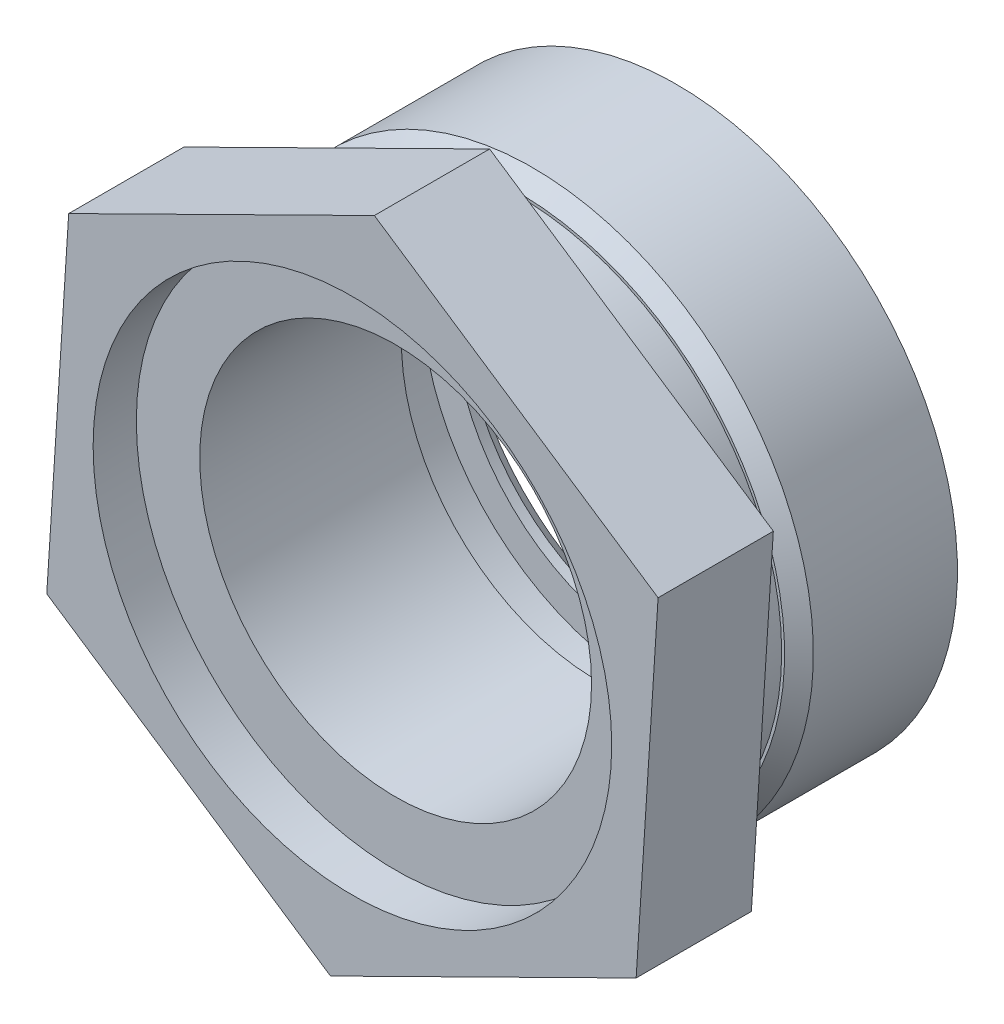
ISO-10303-21;
HEADER;
FILE_DESCRIPTION(('STEP AP214'),'2;1');
FILE_NAME('part.step','',(''),(''),'','','');
FILE_SCHEMA(('AUTOMOTIVE_DESIGN { 1 0 10303 214 1 1 1 1 }'));
ENDSEC;
DATA;
#1=APPLICATION_CONTEXT('core data for automotive mechanical design processes');
#2=APPLICATION_PROTOCOL_DEFINITION('international standard','automotive_design',2000,#1);
#3=PRODUCT_CONTEXT('',#1,'mechanical');
#4=PRODUCT('Part','Part','',(#3));
#5=PRODUCT_RELATED_PRODUCT_CATEGORY('part','',(#4));
#6=PRODUCT_DEFINITION_FORMATION('','',#4);
#7=PRODUCT_DEFINITION_CONTEXT('part definition',#1,'design');
#8=PRODUCT_DEFINITION('design','',#6,#7);
#9=PRODUCT_DEFINITION_SHAPE('','',#8);
#10=(LENGTH_UNIT() NAMED_UNIT(*) SI_UNIT(.MILLI.,.METRE.));
#11=(NAMED_UNIT(*) PLANE_ANGLE_UNIT() SI_UNIT($,.RADIAN.));
#12=(NAMED_UNIT(*) SI_UNIT($,.STERADIAN.) SOLID_ANGLE_UNIT());
#13=UNCERTAINTY_MEASURE_WITH_UNIT(LENGTH_MEASURE(1.E-05),#10,'distance_accuracy_value','');
#14=(GEOMETRIC_REPRESENTATION_CONTEXT(3) GLOBAL_UNCERTAINTY_ASSIGNED_CONTEXT((#13)) GLOBAL_UNIT_ASSIGNED_CONTEXT((#10,
#11,#12)) REPRESENTATION_CONTEXT('',''));
#15=CARTESIAN_POINT('',(0.,0.,0.));
#16=DIRECTION('',(0.,0.,1.));
#17=DIRECTION('',(1.,0.,0.));
#18=AXIS2_PLACEMENT_3D('',#15,#16,#17);
#19=CARTESIAN_POINT('',(0.,0.,-14.5));
#20=DIRECTION('',(0.,0.,1.));
#21=DIRECTION('',(1.,0.,0.));
#22=AXIS2_PLACEMENT_3D('',#19,#20,#21);
#23=CYLINDRICAL_SURFACE('',#22,13.6);
#24=CARTESIAN_POINT('',(0.,0.,-12.6));
#25=DIRECTION('',(0.,0.,-1.));
#26=DIRECTION('',(-1.,0.,0.));
#27=AXIS2_PLACEMENT_3D('',#24,#25,#26);
#28=CIRCLE('',#27,13.6);
#29=CARTESIAN_POINT('',(-13.6,0.,-12.6));
#30=VERTEX_POINT('',#29);
#31=EDGE_CURVE('E162',#30,#30,#28,.F.);
#32=ORIENTED_EDGE('',*,*,#31,.T.);
#33=EDGE_LOOP('',(#32));
#34=FACE_BOUND('',#33,.T.);
#35=CARTESIAN_POINT('',(0.,0.,-13.3));
#36=DIRECTION('',(0.,0.,-1.));
#37=DIRECTION('',(-1.,0.,0.));
#38=AXIS2_PLACEMENT_3D('',#35,#36,#37);
#39=CIRCLE('',#38,13.6);
#40=CARTESIAN_POINT('',(-13.6,0.,-13.3));
#41=VERTEX_POINT('',#40);
#42=EDGE_CURVE('E155',#41,#41,#39,.T.);
#43=ORIENTED_EDGE('',*,*,#42,.T.);
#44=EDGE_LOOP('',(#43));
#45=FACE_BOUND('',#44,.T.);
#46=ADVANCED_FACE('F37',(#34,#45),#23,.F.);
#47=CARTESIAN_POINT('',(-1.52347256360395,-23.6222853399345,8.));
#48=DIRECTION('',(-0.443226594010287,0.896409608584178,0.));
#49=DIRECTION('',(-0.896409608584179,-0.443226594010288,0.));
#50=AXIS2_PLACEMENT_3D('',#47,#48,#49);
#51=PLANE('',#50);
#52=DIRECTION('',(0.896409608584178,0.443226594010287,0.));
#53=VECTOR('',#52,1.);
#54=CARTESIAN_POINT('',(-1.52347256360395,-23.6222853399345,0.));
#55=LINE('',#54,#53);
#56=CARTESIAN_POINT('',(-1.52347256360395,-23.6222853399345,0.));
#57=VERTEX_POINT('',#56);
#58=CARTESIAN_POINT('',(19.695762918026,-13.130508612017,0.));
#59=VERTEX_POINT('',#58);
#60=EDGE_CURVE('E95',#57,#59,#55,.T.);
#61=ORIENTED_EDGE('',*,*,#60,.T.);
#62=DIRECTION('',(0.,0.,-1.));
#63=VECTOR('',#62,1.);
#64=CARTESIAN_POINT('',(19.695762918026,-13.130508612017,8.));
#65=LINE('',#64,#63);
#66=CARTESIAN_POINT('',(19.695762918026,-13.130508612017,8.));
#67=VERTEX_POINT('',#66);
#68=EDGE_CURVE('E103',#67,#59,#65,.T.);
#69=ORIENTED_EDGE('',*,*,#68,.F.);
#70=DIRECTION('',(0.896409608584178,0.443226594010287,0.));
#71=VECTOR('',#70,1.);
#72=CARTESIAN_POINT('',(-1.52347256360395,-23.6222853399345,8.));
#73=LINE('',#72,#71);
#74=CARTESIAN_POINT('',(-1.52347256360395,-23.6222853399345,8.));
#75=VERTEX_POINT('',#74);
#76=EDGE_CURVE('E127',#75,#67,#73,.T.);
#77=ORIENTED_EDGE('',*,*,#76,.F.);
#78=DIRECTION('',(0.,0.,-1.));
#79=VECTOR('',#78,1.);
#80=CARTESIAN_POINT('',(-1.52347256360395,-23.6222853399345,8.));
#81=LINE('',#80,#79);
#82=EDGE_CURVE('E112',#75,#57,#81,.T.);
#83=ORIENTED_EDGE('',*,*,#82,.T.);
#84=EDGE_LOOP('',(#61,#69,#77,#83));
#85=FACE_BOUND('',#84,.T.);
#86=ADVANCED_FACE('F39',(#85),#51,.F.);
#87=CARTESIAN_POINT('',(19.695762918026,-13.130508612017,8.));
#88=DIRECTION('',(-0.997926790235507,0.0643593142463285,0.));
#89=DIRECTION('',(-0.0643593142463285,-0.997926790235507,0.));
#90=AXIS2_PLACEMENT_3D('',#87,#88,#89);
#91=PLANE('',#90);
#92=DIRECTION('',(0.0643593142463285,0.997926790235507,0.));
#93=VECTOR('',#92,1.);
#94=CARTESIAN_POINT('',(19.695762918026,-13.130508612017,0.));
#95=LINE('',#94,#93);
#96=CARTESIAN_POINT('',(21.2192354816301,10.4917767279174,0.));
#97=VERTEX_POINT('',#96);
#98=EDGE_CURVE('E90',#59,#97,#95,.T.);
#99=ORIENTED_EDGE('',*,*,#98,.T.);
#100=DIRECTION('',(0.,0.,-1.));
#101=VECTOR('',#100,1.);
#102=CARTESIAN_POINT('',(21.2192354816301,10.4917767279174,8.));
#103=LINE('',#102,#101);
#104=CARTESIAN_POINT('',(21.2192354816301,10.4917767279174,8.));
#105=VERTEX_POINT('',#104);
#106=EDGE_CURVE('E109',#105,#97,#103,.T.);
#107=ORIENTED_EDGE('',*,*,#106,.F.);
#108=DIRECTION('',(0.0643593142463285,0.997926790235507,0.));
#109=VECTOR('',#108,1.);
#110=CARTESIAN_POINT('',(19.695762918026,-13.130508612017,8.));
#111=LINE('',#110,#109);
#112=EDGE_CURVE('E105',#67,#105,#111,.T.);
#113=ORIENTED_EDGE('',*,*,#112,.F.);
#114=ORIENTED_EDGE('',*,*,#68,.T.);
#115=EDGE_LOOP('',(#99,#107,#113,#114));
#116=FACE_BOUND('',#115,.T.);
#117=ADVANCED_FACE('F104',(#116),#91,.F.);
#118=CARTESIAN_POINT('',(21.2192354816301,10.4917767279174,8.));
#119=DIRECTION('',(-0.55470019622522,-0.83205029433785,0.));
#120=DIRECTION('',(0.83205029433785,-0.55470019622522,0.));
#121=AXIS2_PLACEMENT_3D('',#118,#119,#120);
#122=PLANE('',#121);
#123=DIRECTION('',(-0.83205029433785,0.55470019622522,0.));
#124=VECTOR('',#123,1.);
#125=CARTESIAN_POINT('',(21.2192354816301,10.4917767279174,0.));
#126=LINE('',#125,#124);
#127=CARTESIAN_POINT('',(1.5234725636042,23.6222853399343,0.));
#128=VERTEX_POINT('',#127);
#129=EDGE_CURVE('E97',#97,#128,#126,.T.);
#130=ORIENTED_EDGE('',*,*,#129,.T.);
#131=DIRECTION('',(0.,0.,-1.));
#132=VECTOR('',#131,1.);
#133=CARTESIAN_POINT('',(1.5234725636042,23.6222853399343,8.));
#134=LINE('',#133,#132);
#135=CARTESIAN_POINT('',(1.5234725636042,23.6222853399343,8.));
#136=VERTEX_POINT('',#135);
#137=EDGE_CURVE('E143',#136,#128,#134,.T.);
#138=ORIENTED_EDGE('',*,*,#137,.F.);
#139=DIRECTION('',(-0.83205029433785,0.55470019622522,0.));
#140=VECTOR('',#139,1.);
#141=CARTESIAN_POINT('',(21.2192354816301,10.4917767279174,8.));
#142=LINE('',#141,#140);
#143=EDGE_CURVE('E130',#105,#136,#142,.T.);
#144=ORIENTED_EDGE('',*,*,#143,.F.);
#145=ORIENTED_EDGE('',*,*,#106,.T.);
#146=EDGE_LOOP('',(#130,#138,#144,#145));
#147=FACE_BOUND('',#146,.T.);
#148=ADVANCED_FACE('F271',(#147),#122,.F.);
#149=CARTESIAN_POINT('',(1.5234725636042,23.6222853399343,8.));
#150=DIRECTION('',(0.443226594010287,-0.896409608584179,0.));
#151=DIRECTION('',(0.896409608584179,0.443226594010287,0.));
#152=AXIS2_PLACEMENT_3D('',#149,#150,#151);
#153=PLANE('',#152);
#154=DIRECTION('',(-0.896409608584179,-0.443226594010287,0.));
#155=VECTOR('',#154,1.);
#156=CARTESIAN_POINT('',(1.5234725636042,23.6222853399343,0.));
#157=LINE('',#156,#155);
#158=CARTESIAN_POINT('',(-19.6957629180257,13.1305086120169,0.));
#159=VERTEX_POINT('',#158);
#160=EDGE_CURVE('E121',#128,#159,#157,.T.);
#161=ORIENTED_EDGE('',*,*,#160,.T.);
#162=DIRECTION('',(0.,0.,-1.));
#163=VECTOR('',#162,1.);
#164=CARTESIAN_POINT('',(-19.6957629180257,13.1305086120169,8.));
#165=LINE('',#164,#163);
#166=CARTESIAN_POINT('',(-19.6957629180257,13.1305086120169,8.));
#167=VERTEX_POINT('',#166);
#168=EDGE_CURVE('E140',#167,#159,#165,.T.);
#169=ORIENTED_EDGE('',*,*,#168,.F.);
#170=DIRECTION('',(-0.896409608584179,-0.443226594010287,0.));
#171=VECTOR('',#170,1.);
#172=CARTESIAN_POINT('',(1.5234725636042,23.6222853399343,8.));
#173=LINE('',#172,#171);
#174=EDGE_CURVE('E132',#136,#167,#173,.T.);
#175=ORIENTED_EDGE('',*,*,#174,.F.);
#176=ORIENTED_EDGE('',*,*,#137,.T.);
#177=EDGE_LOOP('',(#161,#169,#175,#176));
#178=FACE_BOUND('',#177,.T.);
#179=ADVANCED_FACE('F267',(#178),#153,.F.);
#180=CARTESIAN_POINT('',(-19.6957629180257,13.1305086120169,8.));
#181=DIRECTION('',(0.997926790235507,-0.0643593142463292,0.));
#182=DIRECTION('',(0.0643593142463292,0.997926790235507,0.));
#183=AXIS2_PLACEMENT_3D('',#180,#181,#182);
#184=PLANE('',#183);
#185=DIRECTION('',(-0.0643593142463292,-0.997926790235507,0.));
#186=VECTOR('',#185,1.);
#187=CARTESIAN_POINT('',(-19.6957629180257,13.1305086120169,0.));
#188=LINE('',#187,#186);
#189=CARTESIAN_POINT('',(-21.2192354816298,-10.4917767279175,0.));
#190=VERTEX_POINT('',#189);
#191=EDGE_CURVE('E123',#159,#190,#188,.T.);
#192=ORIENTED_EDGE('',*,*,#191,.T.);
#193=DIRECTION('',(0.,0.,-1.));
#194=VECTOR('',#193,1.);
#195=CARTESIAN_POINT('',(-21.2192354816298,-10.4917767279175,8.));
#196=LINE('',#195,#194);
#197=CARTESIAN_POINT('',(-21.2192354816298,-10.4917767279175,8.));
#198=VERTEX_POINT('',#197);
#199=EDGE_CURVE('E137',#198,#190,#196,.T.);
#200=ORIENTED_EDGE('',*,*,#199,.F.);
#201=DIRECTION('',(-0.0643593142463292,-0.997926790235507,0.));
#202=VECTOR('',#201,1.);
#203=CARTESIAN_POINT('',(-19.6957629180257,13.1305086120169,8.));
#204=LINE('',#203,#202);
#205=EDGE_CURVE('E57',#167,#198,#204,.T.);
#206=ORIENTED_EDGE('',*,*,#205,.F.);
#207=ORIENTED_EDGE('',*,*,#168,.T.);
#208=EDGE_LOOP('',(#192,#200,#206,#207));
#209=FACE_BOUND('',#208,.T.);
#210=ADVANCED_FACE('F263',(#209),#184,.F.);
#211=CARTESIAN_POINT('',(-21.2192354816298,-10.4917767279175,8.));
#212=DIRECTION('',(0.55470019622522,0.83205029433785,0.));
#213=DIRECTION('',(-0.83205029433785,0.55470019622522,0.));
#214=AXIS2_PLACEMENT_3D('',#211,#212,#213);
#215=PLANE('',#214);
#216=DIRECTION('',(0.83205029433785,-0.55470019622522,0.));
#217=VECTOR('',#216,1.);
#218=CARTESIAN_POINT('',(-21.2192354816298,-10.4917767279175,0.));
#219=LINE('',#218,#217);
#220=EDGE_CURVE('E125',#190,#57,#219,.T.);
#221=ORIENTED_EDGE('',*,*,#220,.T.);
#222=ORIENTED_EDGE('',*,*,#82,.F.);
#223=DIRECTION('',(0.83205029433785,-0.55470019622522,0.));
#224=VECTOR('',#223,1.);
#225=CARTESIAN_POINT('',(-21.2192354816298,-10.4917767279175,8.));
#226=LINE('',#225,#224);
#227=EDGE_CURVE('E52',#198,#75,#226,.T.);
#228=ORIENTED_EDGE('',*,*,#227,.F.);
#229=ORIENTED_EDGE('',*,*,#199,.T.);
#230=EDGE_LOOP('',(#221,#222,#228,#229));
#231=FACE_BOUND('',#230,.T.);
#232=ADVANCED_FACE('F259',(#231),#215,.F.);
#233=CARTESIAN_POINT('',(40.9149983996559,-2.63873188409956,8.));
#234=DIRECTION('',(0.,0.,1.));
#235=DIRECTION('',(1.,0.,0.));
#236=AXIS2_PLACEMENT_3D('',#233,#234,#235);
#237=PLANE('',#236);
#238=CARTESIAN_POINT('',(0.,0.,8.));
#239=DIRECTION('',(0.,0.,1.));
#240=DIRECTION('',(1.,0.,0.));
#241=AXIS2_PLACEMENT_3D('',#238,#239,#240);
#242=CIRCLE('',#241,18.);
#243=CARTESIAN_POINT('',(18.,0.,8.));
#244=VERTEX_POINT('',#243);
#245=EDGE_CURVE('E232',#244,#244,#242,.T.);
#246=ORIENTED_EDGE('',*,*,#245,.F.);
#247=EDGE_LOOP('',(#246));
#248=FACE_BOUND('',#247,.T.);
#249=ORIENTED_EDGE('',*,*,#76,.T.);
#250=ORIENTED_EDGE('',*,*,#112,.T.);
#251=ORIENTED_EDGE('',*,*,#143,.T.);
#252=ORIENTED_EDGE('',*,*,#174,.T.);
#253=ORIENTED_EDGE('',*,*,#205,.T.);
#254=ORIENTED_EDGE('',*,*,#227,.T.);
#255=EDGE_LOOP('',(#249,#250,#251,#252,#253,#254));
#256=FACE_BOUND('',#255,.T.);
#257=ADVANCED_FACE('F255',(#248,#256),#237,.T.);
#258=CARTESIAN_POINT('',(40.9149983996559,-2.63873188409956,0.));
#259=DIRECTION('',(0.,0.,1.));
#260=DIRECTION('',(1.,0.,0.));
#261=AXIS2_PLACEMENT_3D('',#258,#259,#260);
#262=PLANE('',#261);
#263=CARTESIAN_POINT('',(0.,0.,0.));
#264=DIRECTION('',(0.,0.,1.));
#265=DIRECTION('',(1.,0.,0.));
#266=AXIS2_PLACEMENT_3D('',#263,#264,#265);
#267=CIRCLE('',#266,19.5828427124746);
#268=CARTESIAN_POINT('',(19.5828427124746,0.,0.));
#269=VERTEX_POINT('',#268);
#270=EDGE_CURVE('E11',#269,#269,#267,.T.);
#271=ORIENTED_EDGE('',*,*,#270,.T.);
#272=EDGE_LOOP('',(#271));
#273=FACE_BOUND('',#272,.T.);
#274=ORIENTED_EDGE('',*,*,#60,.F.);
#275=ORIENTED_EDGE('',*,*,#220,.F.);
#276=ORIENTED_EDGE('',*,*,#191,.F.);
#277=ORIENTED_EDGE('',*,*,#160,.F.);
#278=ORIENTED_EDGE('',*,*,#129,.F.);
#279=ORIENTED_EDGE('',*,*,#98,.F.);
#280=EDGE_LOOP('',(#274,#275,#276,#277,#278,#279));
#281=FACE_BOUND('',#280,.T.);
#282=ADVANCED_FACE('F92',(#273,#281),#262,.F.);
#283=CARTESIAN_POINT('',(0.,0.,-10.));
#284=DIRECTION('',(0.,0.,-1.));
#285=DIRECTION('',(-1.,0.,0.));
#286=AXIS2_PLACEMENT_3D('',#283,#284,#285);
#287=CYLINDRICAL_SURFACE('',#286,18.3);
#288=CARTESIAN_POINT('',(0.,0.,-1.28284271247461));
#289=DIRECTION('',(0.,0.,-1.));
#290=DIRECTION('',(-1.,0.,0.));
#291=AXIS2_PLACEMENT_3D('',#288,#289,#290);
#292=CIRCLE('',#291,18.3);
#293=CARTESIAN_POINT('',(-18.3,0.,-1.28284271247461));
#294=VERTEX_POINT('',#293);
#295=EDGE_CURVE('E158',#294,#294,#292,.T.);
#296=ORIENTED_EDGE('',*,*,#295,.T.);
#297=EDGE_LOOP('',(#296));
#298=FACE_BOUND('',#297,.T.);
#299=CARTESIAN_POINT('',(0.,0.,-3.5));
#300=DIRECTION('',(0.,0.,-1.));
#301=DIRECTION('',(-1.,0.,0.));
#302=AXIS2_PLACEMENT_3D('',#299,#300,#301);
#303=CIRCLE('',#302,18.3);
#304=CARTESIAN_POINT('',(-18.3,0.,-3.5));
#305=VERTEX_POINT('',#304);
#306=EDGE_CURVE('E113',#305,#305,#303,.T.);
#307=ORIENTED_EDGE('',*,*,#306,.F.);
#308=EDGE_LOOP('',(#307));
#309=FACE_BOUND('',#308,.T.);
#310=ADVANCED_FACE('F185',(#298,#309),#287,.T.);
#311=CARTESIAN_POINT('',(0.,0.,-1.19999999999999));
#312=DIRECTION('',(0.,0.,1.));
#313=DIRECTION('',(1.,0.,0.));
#314=AXIS2_PLACEMENT_3D('',#311,#312,#313);
#315=CONICAL_SURFACE('',#314,18.3,0.785398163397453);
#316=CARTESIAN_POINT('',(0.,0.,-1.1414213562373));
#317=DIRECTION('',(0.,0.,1.));
#318=DIRECTION('',(1.,0.,0.));
#319=AXIS2_PLACEMENT_3D('',#316,#317,#318);
#320=CIRCLE('',#319,18.3585786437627);
#321=CARTESIAN_POINT('',(18.3585786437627,0.,-1.1414213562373));
#322=VERTEX_POINT('',#321);
#323=EDGE_CURVE('E45',#322,#322,#320,.T.);
#324=ORIENTED_EDGE('',*,*,#323,.T.);
#325=EDGE_LOOP('',(#324));
#326=FACE_BOUND('',#325,.T.);
#327=CARTESIAN_POINT('',(0.,0.,-0.0585786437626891));
#328=DIRECTION('',(0.,0.,-1.));
#329=DIRECTION('',(-1.,0.,0.));
#330=AXIS2_PLACEMENT_3D('',#327,#328,#329);
#331=CIRCLE('',#330,19.4414213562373);
#332=CARTESIAN_POINT('',(-19.4414213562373,0.,-0.0585786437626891));
#333=VERTEX_POINT('',#332);
#334=EDGE_CURVE('E169',#333,#333,#331,.T.);
#335=ORIENTED_EDGE('',*,*,#334,.T.);
#336=EDGE_LOOP('',(#335));
#337=FACE_BOUND('',#336,.T.);
#338=ADVANCED_FACE('F174',(#326,#337),#315,.T.);
#339=CARTESIAN_POINT('',(0.,0.,-14.5));
#340=DIRECTION('',(0.,0.,1.));
#341=DIRECTION('',(1.,0.,0.));
#342=AXIS2_PLACEMENT_3D('',#339,#340,#341);
#343=CYLINDRICAL_SURFACE('',#342,19.5);
#344=CARTESIAN_POINT('',(0.,0.,-4.5));
#345=DIRECTION('',(0.,0.,-1.));
#346=DIRECTION('',(-1.,0.,0.));
#347=AXIS2_PLACEMENT_3D('',#344,#345,#346);
#348=CIRCLE('',#347,19.5);
#349=CARTESIAN_POINT('',(-19.5,0.,-4.5));
#350=VERTEX_POINT('',#349);
#351=EDGE_CURVE('E108',#350,#350,#348,.T.);
#352=ORIENTED_EDGE('',*,*,#351,.T.);
#353=EDGE_LOOP('',(#352));
#354=FACE_BOUND('',#353,.T.);
#355=CARTESIAN_POINT('',(0.,0.,-14.5));
#356=DIRECTION('',(0.,0.,-1.));
#357=DIRECTION('',(-1.,0.,0.));
#358=AXIS2_PLACEMENT_3D('',#355,#356,#357);
#359=CIRCLE('',#358,19.5);
#360=CARTESIAN_POINT('',(-19.5,0.,-14.5));
#361=VERTEX_POINT('',#360);
#362=EDGE_CURVE('E116',#361,#361,#359,.T.);
#363=ORIENTED_EDGE('',*,*,#362,.F.);
#364=EDGE_LOOP('',(#363));
#365=FACE_BOUND('',#364,.T.);
#366=ADVANCED_FACE('F204',(#354,#365),#343,.T.);
#367=CARTESIAN_POINT('',(0.,0.,-14.5));
#368=DIRECTION('',(0.,0.,-1.));
#369=DIRECTION('',(-1.,0.,0.));
#370=AXIS2_PLACEMENT_3D('',#367,#368,#369);
#371=PLANE('',#370);
#372=CARTESIAN_POINT('',(0.,0.,-14.5));
#373=DIRECTION('',(0.,0.,-1.));
#374=DIRECTION('',(-1.,0.,0.));
#375=AXIS2_PLACEMENT_3D('',#372,#373,#374);
#376=CIRCLE('',#375,14.8);
#377=CARTESIAN_POINT('',(-14.8,0.,-14.5));
#378=VERTEX_POINT('',#377);
#379=EDGE_CURVE('E152',#378,#378,#376,.F.);
#380=ORIENTED_EDGE('',*,*,#379,.T.);
#381=EDGE_LOOP('',(#380));
#382=FACE_BOUND('',#381,.T.);
#383=ORIENTED_EDGE('',*,*,#362,.T.);
#384=EDGE_LOOP('',(#383));
#385=FACE_BOUND('',#384,.T.);
#386=ADVANCED_FACE('F194',(#382,#385),#371,.T.);
#387=CARTESIAN_POINT('',(0.,0.,-3.5));
#388=DIRECTION('',(0.,0.,-1.));
#389=DIRECTION('',(-1.,0.,0.));
#390=AXIS2_PLACEMENT_3D('',#387,#388,#389);
#391=PLANE('',#390);
#392=CARTESIAN_POINT('',(0.,0.,-3.5));
#393=DIRECTION('',(0.,0.,-1.));
#394=DIRECTION('',(-1.,0.,0.));
#395=AXIS2_PLACEMENT_3D('',#392,#393,#394);
#396=CIRCLE('',#395,18.5);
#397=CARTESIAN_POINT('',(-18.5,0.,-3.5));
#398=VERTEX_POINT('',#397);
#399=EDGE_CURVE('E149',#398,#398,#396,.F.);
#400=ORIENTED_EDGE('',*,*,#399,.T.);
#401=EDGE_LOOP('',(#400));
#402=FACE_BOUND('',#401,.T.);
#403=ORIENTED_EDGE('',*,*,#306,.T.);
#404=EDGE_LOOP('',(#403));
#405=FACE_BOUND('',#404,.T.);
#406=ADVANCED_FACE('F191',(#402,#405),#391,.F.);
#407=CARTESIAN_POINT('',(0.,0.,-4.5));
#408=DIRECTION('',(0.,0.,-1.));
#409=DIRECTION('',(-1.,0.,0.));
#410=AXIS2_PLACEMENT_3D('',#407,#408,#409);
#411=CONICAL_SURFACE('',#410,19.5,0.78539816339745);
#412=ORIENTED_EDGE('',*,*,#399,.F.);
#413=EDGE_LOOP('',(#412));
#414=FACE_BOUND('',#413,.T.);
#415=ORIENTED_EDGE('',*,*,#351,.F.);
#416=EDGE_LOOP('',(#415));
#417=FACE_BOUND('',#416,.T.);
#418=ADVANCED_FACE('F193',(#414,#417),#411,.T.);
#419=CARTESIAN_POINT('',(0.,0.,5.));
#420=DIRECTION('',(0.,0.,1.));
#421=DIRECTION('',(1.,0.,0.));
#422=AXIS2_PLACEMENT_3D('',#419,#420,#421);
#423=CYLINDRICAL_SURFACE('',#422,18.);
#424=CARTESIAN_POINT('',(0.,0.,5.));
#425=DIRECTION('',(0.,0.,1.));
#426=DIRECTION('',(1.,0.,0.));
#427=AXIS2_PLACEMENT_3D('',#424,#425,#426);
#428=CIRCLE('',#427,18.);
#429=CARTESIAN_POINT('',(18.,0.,5.));
#430=VERTEX_POINT('',#429);
#431=EDGE_CURVE('E235',#430,#430,#428,.T.);
#432=ORIENTED_EDGE('',*,*,#431,.F.);
#433=EDGE_LOOP('',(#432));
#434=FACE_BOUND('',#433,.T.);
#435=ORIENTED_EDGE('',*,*,#245,.T.);
#436=EDGE_LOOP('',(#435));
#437=FACE_BOUND('',#436,.T.);
#438=ADVANCED_FACE('F201',(#434,#437),#423,.F.);
#439=CARTESIAN_POINT('',(0.,0.,5.));
#440=DIRECTION('',(0.,0.,1.));
#441=DIRECTION('',(1.,0.,0.));
#442=AXIS2_PLACEMENT_3D('',#439,#440,#441);
#443=PLANE('',#442);
#444=CARTESIAN_POINT('',(0.,0.,5.));
#445=DIRECTION('',(0.,0.,1.));
#446=DIRECTION('',(1.,0.,0.));
#447=AXIS2_PLACEMENT_3D('',#444,#445,#446);
#448=CIRCLE('',#447,13.6);
#449=CARTESIAN_POINT('',(13.6,0.,5.));
#450=VERTEX_POINT('',#449);
#451=EDGE_CURVE('E166',#450,#450,#448,.T.);
#452=ORIENTED_EDGE('',*,*,#451,.F.);
#453=EDGE_LOOP('',(#452));
#454=FACE_BOUND('',#453,.T.);
#455=ORIENTED_EDGE('',*,*,#431,.T.);
#456=EDGE_LOOP('',(#455));
#457=FACE_BOUND('',#456,.T.);
#458=ADVANCED_FACE('F219',(#454,#457),#443,.T.);
#459=CARTESIAN_POINT('',(0.,0.,-9.));
#460=DIRECTION('',(0.,0.,1.));
#461=DIRECTION('',(1.,0.,0.));
#462=AXIS2_PLACEMENT_3D('',#459,#460,#461);
#463=CIRCLE('',#462,13.6);
#464=CARTESIAN_POINT('',(13.6,0.,-9.));
#465=VERTEX_POINT('',#464);
#466=EDGE_CURVE('E159',#465,#465,#463,.F.);
#467=ORIENTED_EDGE('',*,*,#466,.T.);
#468=EDGE_LOOP('',(#467));
#469=FACE_BOUND('',#468,.T.);
#470=ORIENTED_EDGE('',*,*,#451,.T.);
#471=EDGE_LOOP('',(#470));
#472=FACE_BOUND('',#471,.T.);
#473=ADVANCED_FACE('F210',(#469,#472),#23,.F.);
#474=CARTESIAN_POINT('',(0.,0.,-14.5));
#475=DIRECTION('',(0.,0.,-1.));
#476=DIRECTION('',(-1.,0.,0.));
#477=AXIS2_PLACEMENT_3D('',#474,#475,#476);
#478=CONICAL_SURFACE('',#477,14.8,0.785398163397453);
#479=ORIENTED_EDGE('',*,*,#42,.F.);
#480=EDGE_LOOP('',(#479));
#481=FACE_BOUND('',#480,.T.);
#482=ORIENTED_EDGE('',*,*,#379,.F.);
#483=EDGE_LOOP('',(#482));
#484=FACE_BOUND('',#483,.T.);
#485=ADVANCED_FACE('F218',(#481,#484),#478,.F.);
#486=CARTESIAN_POINT('',(-15.8,0.,-12.6));
#487=DIRECTION('',(0.,0.,-1.));
#488=DIRECTION('',(-1.,0.,0.));
#489=AXIS2_PLACEMENT_3D('',#486,#487,#488);
#490=PLANE('',#489);
#491=CARTESIAN_POINT('',(0.,0.,-12.6));
#492=DIRECTION('',(0.,0.,-1.));
#493=DIRECTION('',(-1.,0.,0.));
#494=AXIS2_PLACEMENT_3D('',#491,#492,#493);
#495=CIRCLE('',#494,15.8);
#496=CARTESIAN_POINT('',(-15.8,0.,-12.6));
#497=VERTEX_POINT('',#496);
#498=EDGE_CURVE('E163',#497,#497,#495,.T.);
#499=ORIENTED_EDGE('',*,*,#498,.F.);
#500=EDGE_LOOP('',(#499));
#501=FACE_BOUND('',#500,.T.);
#502=ORIENTED_EDGE('',*,*,#31,.F.);
#503=EDGE_LOOP('',(#502));
#504=FACE_BOUND('',#503,.T.);
#505=ADVANCED_FACE('F225',(#501,#504),#490,.F.);
#506=CARTESIAN_POINT('',(-15.8,0.,-9.));
#507=DIRECTION('',(0.,0.,1.));
#508=DIRECTION('',(1.,0.,0.));
#509=AXIS2_PLACEMENT_3D('',#506,#507,#508);
#510=PLANE('',#509);
#511=CARTESIAN_POINT('',(0.,0.,-9.));
#512=DIRECTION('',(0.,0.,-1.));
#513=DIRECTION('',(-1.,0.,0.));
#514=AXIS2_PLACEMENT_3D('',#511,#512,#513);
#515=CIRCLE('',#514,15.8);
#516=CARTESIAN_POINT('',(-15.8,0.,-9.));
#517=VERTEX_POINT('',#516);
#518=EDGE_CURVE('E411',#517,#517,#515,.T.);
#519=ORIENTED_EDGE('',*,*,#518,.T.);
#520=EDGE_LOOP('',(#519));
#521=FACE_BOUND('',#520,.T.);
#522=ORIENTED_EDGE('',*,*,#466,.F.);
#523=EDGE_LOOP('',(#522));
#524=FACE_BOUND('',#523,.T.);
#525=ADVANCED_FACE('F367',(#521,#524),#510,.F.);
#526=CARTESIAN_POINT('',(0.,0.,-16.5469406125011));
#527=DIRECTION('',(0.,0.,-1.));
#528=DIRECTION('',(-1.,0.,0.));
#529=AXIS2_PLACEMENT_3D('',#526,#527,#528);
#530=CYLINDRICAL_SURFACE('',#529,15.8);
#531=ORIENTED_EDGE('',*,*,#518,.F.);
#532=EDGE_LOOP('',(#531));
#533=FACE_BOUND('',#532,.T.);
#534=ORIENTED_EDGE('',*,*,#498,.T.);
#535=EDGE_LOOP('',(#534));
#536=FACE_BOUND('',#535,.T.);
#537=ADVANCED_FACE('F181',(#533,#536),#530,.F.);
#538=CARTESIAN_POINT('',(0.,0.,-1.28284271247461));
#539=DIRECTION('',(0.,0.,-1.));
#540=DIRECTION('',(-1.,0.,0.));
#541=AXIS2_PLACEMENT_3D('',#538,#539,#540);
#542=TOROIDAL_SURFACE('',#541,18.5,0.2);
#543=ORIENTED_EDGE('',*,*,#323,.F.);
#544=EDGE_LOOP('',(#543));
#545=FACE_BOUND('',#544,.T.);
#546=ORIENTED_EDGE('',*,*,#295,.F.);
#547=EDGE_LOOP('',(#546));
#548=FACE_BOUND('',#547,.T.);
#549=ADVANCED_FACE('F177',(#545,#548),#542,.F.);
#550=CARTESIAN_POINT('',(0.,0.,-0.2));
#551=DIRECTION('',(0.,0.,1.));
#552=DIRECTION('',(1.,0.,0.));
#553=AXIS2_PLACEMENT_3D('',#550,#551,#552);
#554=TOROIDAL_SURFACE('',#553,19.5828427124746,0.2);
#555=ORIENTED_EDGE('',*,*,#270,.F.);
#556=EDGE_LOOP('',(#555));
#557=FACE_BOUND('',#556,.T.);
#558=ORIENTED_EDGE('',*,*,#334,.F.);
#559=EDGE_LOOP('',(#558));
#560=FACE_BOUND('',#559,.T.);
#561=ADVANCED_FACE('F180',(#557,#560),#554,.F.);
#562=CLOSED_SHELL('',(#46,#86,#117,#148,#179,#210,#232,#257,#282,#310,#338,#366,#386,#406,#418,
#438,#458,#473,#485,#505,#525,#537,#549,#561));
#563=MANIFOLD_SOLID_BREP('B2',#562);
#564=ADVANCED_BREP_SHAPE_REPRESENTATION('',(#18,#563),#14);
#565=SHAPE_DEFINITION_REPRESENTATION(#9,#564);
ENDSEC;
END-ISO-10303-21;
